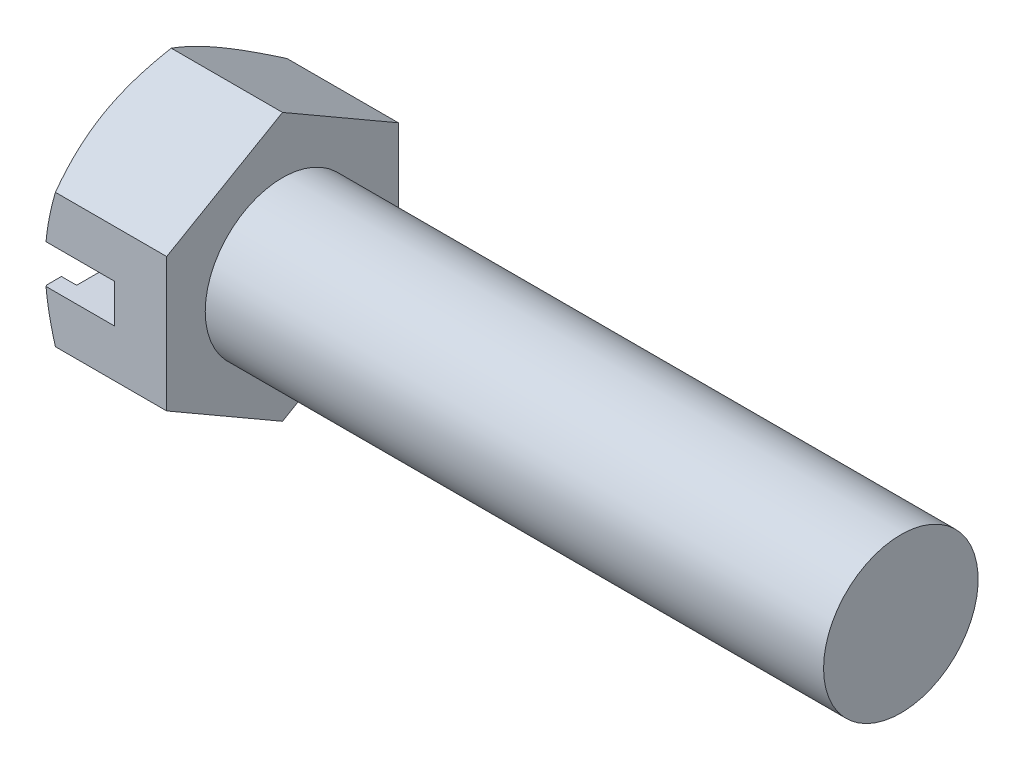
ISO-10303-21;
HEADER;
FILE_DESCRIPTION(('STEP AP214'),'2;1');
FILE_NAME('part.step','',(''),(''),'','','');
FILE_SCHEMA(('AUTOMOTIVE_DESIGN { 1 0 10303 214 1 1 1 1 }'));
ENDSEC;
DATA;
#1=APPLICATION_CONTEXT('core data for automotive mechanical design processes');
#2=APPLICATION_PROTOCOL_DEFINITION('international standard','automotive_design',2000,#1);
#3=PRODUCT_CONTEXT('',#1,'mechanical');
#4=PRODUCT('Part','Part','',(#3));
#5=PRODUCT_RELATED_PRODUCT_CATEGORY('part','',(#4));
#6=PRODUCT_DEFINITION_FORMATION('','',#4);
#7=PRODUCT_DEFINITION_CONTEXT('part definition',#1,'design');
#8=PRODUCT_DEFINITION('design','',#6,#7);
#9=PRODUCT_DEFINITION_SHAPE('','',#8);
#10=(LENGTH_UNIT() NAMED_UNIT(*) SI_UNIT(.MILLI.,.METRE.));
#11=(NAMED_UNIT(*) PLANE_ANGLE_UNIT() SI_UNIT($,.RADIAN.));
#12=(NAMED_UNIT(*) SI_UNIT($,.STERADIAN.) SOLID_ANGLE_UNIT());
#13=UNCERTAINTY_MEASURE_WITH_UNIT(LENGTH_MEASURE(1.E-05),#10,'distance_accuracy_value','');
#14=(GEOMETRIC_REPRESENTATION_CONTEXT(3) GLOBAL_UNCERTAINTY_ASSIGNED_CONTEXT((#13)) GLOBAL_UNIT_ASSIGNED_CONTEXT((#10,
#11,#12)) REPRESENTATION_CONTEXT('',''));
#15=CARTESIAN_POINT('',(0.,0.,0.));
#16=DIRECTION('',(0.,0.,1.));
#17=DIRECTION('',(1.,0.,0.));
#18=AXIS2_PLACEMENT_3D('',#15,#16,#17);
#19=CARTESIAN_POINT('',(4.2672,-1.1938,-8.241801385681));
#20=DIRECTION('',(0.,1.,0.));
#21=DIRECTION('',(0.,0.,1.));
#22=AXIS2_PLACEMENT_3D('',#19,#20,#21);
#23=PLANE('',#22);
#24=DIRECTION('',(0.,0.,-1.));
#25=VECTOR('',#24,1.);
#26=CARTESIAN_POINT('',(0.,-1.1938,0.));
#27=LINE('',#26,#25);
#28=CARTESIAN_POINT('',(0.,-1.1938,-6.13006336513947));
#29=VERTEX_POINT('',#28);
#30=CARTESIAN_POINT('',(0.,-1.1938,-7.03685443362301));
#31=VERTEX_POINT('',#30);
#32=EDGE_CURVE('E182',#29,#31,#27,.T.);
#33=ORIENTED_EDGE('',*,*,#32,.F.);
#34=DIRECTION('',(-1.,0.,0.));
#35=VECTOR('',#34,1.);
#36=CARTESIAN_POINT('',(0.936625,-1.1938,-6.13006336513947));
#37=LINE('',#36,#35);
#38=CARTESIAN_POINT('',(0.936625,-1.1938,-6.13006336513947));
#39=VERTEX_POINT('',#38);
#40=EDGE_CURVE('E426',#29,#39,#37,.F.);
#41=ORIENTED_EDGE('',*,*,#40,.T.);
#42=DIRECTION('',(0.,0.,-1.));
#43=VECTOR('',#42,1.);
#44=CARTESIAN_POINT('',(0.936625,-1.1938,-8.241801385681));
#45=LINE('',#44,#43);
#46=CARTESIAN_POINT('',(0.936625,-1.1938,6.13006336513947));
#47=VERTEX_POINT('',#46);
#48=EDGE_CURVE('E196',#47,#39,#45,.T.);
#49=ORIENTED_EDGE('',*,*,#48,.F.);
#50=DIRECTION('',(-1.,0.,0.));
#51=VECTOR('',#50,1.);
#52=CARTESIAN_POINT('',(0.936625,-1.1938,6.13006336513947));
#53=LINE('',#52,#51);
#54=CARTESIAN_POINT('',(0.,-1.1938,6.13006336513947));
#55=VERTEX_POINT('',#54);
#56=EDGE_CURVE('E446',#47,#55,#53,.T.);
#57=ORIENTED_EDGE('',*,*,#56,.T.);
#58=CARTESIAN_POINT('',(0.,-1.1938,7.03685443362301));
#59=VERTEX_POINT('',#58);
#60=EDGE_CURVE('E185',#59,#55,#27,.T.);
#61=ORIENTED_EDGE('',*,*,#60,.F.);
#62=CARTESIAN_POINT('',(3.26043260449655,-1.1938,12.7287757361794));
#63=CARTESIAN_POINT('',(2.98204474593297,-1.1938,12.2444551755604));
#64=CARTESIAN_POINT('',(2.70374242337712,-1.1938,11.7600853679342));
#65=CARTESIAN_POINT('',(2.14746424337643,-1.1938,10.79121068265));
#66=CARTESIAN_POINT('',(1.8694883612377,-1.1938,10.3067058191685));
#67=CARTESIAN_POINT('',(1.31403888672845,-1.1938,9.33756042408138));
#68=CARTESIAN_POINT('',(1.03656519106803,-1.1938,8.85291995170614));
#69=CARTESIAN_POINT('',(0.620878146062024,-1.1938,8.12563576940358));
#70=CARTESIAN_POINT('',(0.482397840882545,-1.1938,7.88314465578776));
#71=CARTESIAN_POINT('',(0.205671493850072,-1.1938,7.39802631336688));
#72=CARTESIAN_POINT('',(0.0674254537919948,-1.1938,7.1553990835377));
#73=CARTESIAN_POINT('',(-0.208818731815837,-1.1938,6.66984777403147));
#74=CARTESIAN_POINT('',(-0.346816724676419,-1.1938,6.42692360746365));
#75=CARTESIAN_POINT('',(-0.62237324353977,-1.1938,5.94083477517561));
#76=CARTESIAN_POINT('',(-0.759931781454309,-1.1938,5.69767011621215));
#77=CARTESIAN_POINT('',(-1.03438897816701,-1.1938,5.21104351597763));
#78=CARTESIAN_POINT('',(-1.17128778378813,-1.1938,4.96758165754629));
#79=CARTESIAN_POINT('',(-1.4441587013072,-1.1938,4.48010659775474));
#80=CARTESIAN_POINT('',(-1.58013072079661,-1.1938,4.23609334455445));
#81=CARTESIAN_POINT('',(-1.7829941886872,-1.1938,3.86933760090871));
#82=CARTESIAN_POINT('',(-1.85046016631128,-1.1938,3.74691304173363));
#83=CARTESIAN_POINT('',(-1.98488099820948,-1.1938,3.50178681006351));
#84=CARTESIAN_POINT('',(-2.05183586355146,-1.1938,3.37908514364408));
#85=CARTESIAN_POINT('',(-2.18504184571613,-1.1938,3.13334895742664));
#86=CARTESIAN_POINT('',(-2.25129317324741,-1.1938,3.01031455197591));
#87=CARTESIAN_POINT('',(-2.38285615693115,-1.1938,2.7637302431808));
#88=CARTESIAN_POINT('',(-2.44816773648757,-1.1938,2.64018029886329));
#89=CARTESIAN_POINT('',(-2.57750557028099,-1.1938,2.39222873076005));
#90=CARTESIAN_POINT('',(-2.64153027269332,-1.1938,2.26782629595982));
#91=CARTESIAN_POINT('',(-2.76753475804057,-1.1938,2.01801587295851));
#92=CARTESIAN_POINT('',(-2.82951499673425,-1.1938,1.89260811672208));
#93=CARTESIAN_POINT('',(-2.92008574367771,-1.1938,1.7032539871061));
#94=CARTESIAN_POINT('',(-2.94989305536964,-1.1938,1.63989083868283));
#95=CARTESIAN_POINT('',(-3.0084424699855,-1.1938,1.51268002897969));
#96=CARTESIAN_POINT('',(-3.03718466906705,-1.1938,1.44883241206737));
#97=CARTESIAN_POINT('',(-3.09331464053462,-1.1938,1.32048035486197));
#98=CARTESIAN_POINT('',(-3.12070135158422,-1.1938,1.25597544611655));
#99=CARTESIAN_POINT('',(-3.17361063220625,-1.1938,1.12618456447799));
#100=CARTESIAN_POINT('',(-3.19913261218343,-1.1938,1.06089835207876));
#101=CARTESIAN_POINT('',(-3.223470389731,-1.1938,0.995155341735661));
#102=B_SPLINE_CURVE_WITH_KNOTS('',3,(#62,#63,#64,#65,#66,#67,#68,#69,#70,#71,#72,#73,#74,#75,
#76,#77,#78,#79,#80,#81,#82,#83,#84,#85,#86,#87,#88,#89,#90,#91,#92,#93,#94,#95,#96,#97,#98,#99,
#100,#101),.UNSPECIFIED.,.F.,.F.,(4,2,2,2,2,2,2,2,2,2,2,2,2,2,2,2,2,2,2,4),(0.,1.67588667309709,
3.35163714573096,5.02699109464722,5.86473118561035,6.70247766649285,7.54063032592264,
8.37876007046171,9.21669377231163,10.054709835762,10.4740595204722,10.8934000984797,
11.3126113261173,11.7318565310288,12.1515801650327,12.5712095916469,12.7812741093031,
12.9913196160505,13.2015270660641,13.4118006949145),.UNSPECIFIED.);
#103=CARTESIAN_POINT('',(0.0572435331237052,-1.1938,7.1374));
#104=VERTEX_POINT('',#103);
#105=EDGE_CURVE('E311',#104,#59,#102,.T.);
#106=ORIENTED_EDGE('',*,*,#105,.F.);
#107=DIRECTION('',(-1.,0.,0.));
#108=VECTOR('',#107,1.);
#109=CARTESIAN_POINT('',(7.493,-1.1938,7.1374));
#110=LINE('',#109,#108);
#111=CARTESIAN_POINT('',(4.2672,-1.1938,7.1374));
#112=VERTEX_POINT('',#111);
#113=EDGE_CURVE('E318',#112,#104,#110,.T.);
#114=ORIENTED_EDGE('',*,*,#113,.F.);
#115=DIRECTION('',(0.,0.,-1.));
#116=VECTOR('',#115,1.);
#117=CARTESIAN_POINT('',(4.2672,-1.1938,-8.241801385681));
#118=LINE('',#117,#116);
#119=CARTESIAN_POINT('',(4.2672,-1.1938,-7.1374));
#120=VERTEX_POINT('',#119);
#121=EDGE_CURVE('E421',#112,#120,#118,.T.);
#122=ORIENTED_EDGE('',*,*,#121,.T.);
#123=DIRECTION('',(1.,0.,0.));
#124=VECTOR('',#123,1.);
#125=CARTESIAN_POINT('',(7.493,-1.1938,-7.1374));
#126=LINE('',#125,#124);
#127=CARTESIAN_POINT('',(0.0572435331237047,-1.1938,-7.1374));
#128=VERTEX_POINT('',#127);
#129=EDGE_CURVE('E319',#128,#120,#126,.T.);
#130=ORIENTED_EDGE('',*,*,#129,.F.);
#131=CARTESIAN_POINT('',(-3.223470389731,-1.1938,-0.995155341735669));
#132=CARTESIAN_POINT('',(-3.19924138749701,-1.1938,-1.06060564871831));
#133=CARTESIAN_POINT('',(-3.17383818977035,-1.1938,-1.1256031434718));
#134=CARTESIAN_POINT('',(-3.12118075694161,-1.1938,-1.25482287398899));
#135=CARTESIAN_POINT('',(-3.09392710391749,-1.1938,-1.31904534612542));
#136=CARTESIAN_POINT('',(-3.03807357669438,-1.1938,-1.44683300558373));
#137=CARTESIAN_POINT('',(-3.00947484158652,-1.1938,-1.51039869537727));
#138=CARTESIAN_POINT('',(-2.95121813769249,-1.1938,-1.63704855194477));
#139=CARTESIAN_POINT('',(-2.9215600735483,-1.1938,-1.7001326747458));
#140=CARTESIAN_POINT('',(-2.83143708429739,-1.1938,-1.88866522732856));
#141=CARTESIAN_POINT('',(-2.76976096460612,-1.1938,-2.01353350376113));
#142=CARTESIAN_POINT('',(-2.64436453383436,-1.1938,-2.26227255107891));
#143=CARTESIAN_POINT('',(-2.58064367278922,-1.1938,-2.38614304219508));
#144=CARTESIAN_POINT('',(-2.41929157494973,-1.1938,-2.69563915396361));
#145=CARTESIAN_POINT('',(-2.32080635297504,-1.1938,-2.88081872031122));
#146=CARTESIAN_POINT('',(-2.12205686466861,-1.1938,-3.25022110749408));
#147=CARTESIAN_POINT('',(-2.02179255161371,-1.1938,-3.43444390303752));
#148=CARTESIAN_POINT('',(-1.82013033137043,-1.1938,-3.80225262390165));
#149=CARTESIAN_POINT('',(-1.71873249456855,-1.1938,-3.98583858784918));
#150=CARTESIAN_POINT('',(-1.51516860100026,-1.1938,-4.35258440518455));
#151=CARTESIAN_POINT('',(-1.41300254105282,-1.1938,-4.53574425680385));
#152=CARTESIAN_POINT('',(-1.10543651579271,-1.1938,-5.0852656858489));
#153=CARTESIAN_POINT('',(-0.89923856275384,-1.1938,-5.45118036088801));
#154=CARTESIAN_POINT('',(-0.485698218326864,-1.1938,-6.18235721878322));
#155=CARTESIAN_POINT('',(-0.278355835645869,-1.1938,-6.54761940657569));
#156=CARTESIAN_POINT('',(0.205814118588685,-1.1938,-7.39864831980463));
#157=CARTESIAN_POINT('',(0.482912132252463,-1.1938,-7.88426115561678));
#158=CARTESIAN_POINT('',(1.03780984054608,-1.1938,-8.85508746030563));
#159=CARTESIAN_POINT('',(1.31560953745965,-1.1938,-9.34030092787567));
#160=CARTESIAN_POINT('',(1.87108240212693,-1.1938,-10.3094870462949));
#161=CARTESIAN_POINT('',(2.14875467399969,-1.1938,-10.7934602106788));
#162=CARTESIAN_POINT('',(2.70440087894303,-1.1938,-11.7612302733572));
#163=CARTESIAN_POINT('',(2.98237481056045,-1.1938,-12.2450271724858));
#164=CARTESIAN_POINT('',(3.26043260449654,-1.1938,-12.7287757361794));
#165=B_SPLINE_CURVE_WITH_KNOTS('',3,(#131,#132,#133,#134,#135,#136,#137,#138,#139,#140,#141,
#142,#143,#144,#145,#146,#147,#148,#149,#150,#151,#152,#153,#154,#155,#156,#157,#158,#159,#160,
#161,#162,#163,#164),.UNSPECIFIED.,.F.,.F.,(4,2,2,2,2,2,2,2,2,2,2,2,2,2,2,2,4),(0.,
0.209337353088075,0.418609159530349,0.627706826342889,0.836823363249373,1.2545977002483,
1.6724853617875,2.30168509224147,2.93090137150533,3.560078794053,4.1892588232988,
5.44929382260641,6.70931924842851,8.3866456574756,10.0639775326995,11.7378911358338,
13.4117967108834),.UNSPECIFIED.);
#166=EDGE_CURVE('E303',#31,#128,#165,.T.);
#167=ORIENTED_EDGE('',*,*,#166,.F.);
#168=EDGE_LOOP('',(#33,#41,#49,#57,#61,#106,#114,#122,#130,#167));
#169=FACE_BOUND('',#168,.T.);
#170=ADVANCED_FACE('F39',(#169),#23,.T.);
#171=CARTESIAN_POINT('',(4.2672,1.1938,8.241801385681));
#172=DIRECTION('',(0.,-1.,0.));
#173=DIRECTION('',(0.,0.,-1.));
#174=AXIS2_PLACEMENT_3D('',#171,#172,#173);
#175=PLANE('',#174);
#176=DIRECTION('',(0.,0.,1.));
#177=VECTOR('',#176,1.);
#178=CARTESIAN_POINT('',(0.,1.1938,0.));
#179=LINE('',#178,#177);
#180=CARTESIAN_POINT('',(0.,1.1938,6.13006336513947));
#181=VERTEX_POINT('',#180);
#182=CARTESIAN_POINT('',(0.,1.1938,7.03685443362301));
#183=VERTEX_POINT('',#182);
#184=EDGE_CURVE('E183',#181,#183,#179,.T.);
#185=ORIENTED_EDGE('',*,*,#184,.F.);
#186=DIRECTION('',(-1.,0.,0.));
#187=VECTOR('',#186,1.);
#188=CARTESIAN_POINT('',(0.936625,1.1938,6.13006336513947));
#189=LINE('',#188,#187);
#190=CARTESIAN_POINT('',(0.936625,1.1938,6.13006336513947));
#191=VERTEX_POINT('',#190);
#192=EDGE_CURVE('E11',#181,#191,#189,.F.);
#193=ORIENTED_EDGE('',*,*,#192,.T.);
#194=DIRECTION('',(0.,0.,1.));
#195=VECTOR('',#194,1.);
#196=CARTESIAN_POINT('',(0.936625,1.1938,8.241801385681));
#197=LINE('',#196,#195);
#198=CARTESIAN_POINT('',(0.936625,1.1938,-6.13006336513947));
#199=VERTEX_POINT('',#198);
#200=EDGE_CURVE('E176',#199,#191,#197,.T.);
#201=ORIENTED_EDGE('',*,*,#200,.F.);
#202=DIRECTION('',(-1.,0.,0.));
#203=VECTOR('',#202,1.);
#204=CARTESIAN_POINT('',(0.936625,1.1938,-6.13006336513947));
#205=LINE('',#204,#203);
#206=CARTESIAN_POINT('',(0.,1.1938,-6.13006336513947));
#207=VERTEX_POINT('',#206);
#208=EDGE_CURVE('E47',#199,#207,#205,.T.);
#209=ORIENTED_EDGE('',*,*,#208,.T.);
#210=CARTESIAN_POINT('',(0.,1.1938,-7.03685443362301));
#211=VERTEX_POINT('',#210);
#212=EDGE_CURVE('E174',#211,#207,#179,.T.);
#213=ORIENTED_EDGE('',*,*,#212,.F.);
#214=CARTESIAN_POINT('',(3.26043260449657,1.1938,-12.7287757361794));
#215=CARTESIAN_POINT('',(2.98204474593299,1.1938,-12.2444551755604));
#216=CARTESIAN_POINT('',(2.70374242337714,1.1938,-11.7600853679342));
#217=CARTESIAN_POINT('',(2.14746424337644,1.1938,-10.7912106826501));
#218=CARTESIAN_POINT('',(1.86948836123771,1.1938,-10.3067058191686));
#219=CARTESIAN_POINT('',(1.31403888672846,1.1938,-9.33756042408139));
#220=CARTESIAN_POINT('',(1.03656519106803,1.1938,-8.85291995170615));
#221=CARTESIAN_POINT('',(0.620878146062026,1.1938,-8.12563576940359));
#222=CARTESIAN_POINT('',(0.482397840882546,1.1938,-7.88314465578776));
#223=CARTESIAN_POINT('',(0.205671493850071,1.1938,-7.39802631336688));
#224=CARTESIAN_POINT('',(0.0674254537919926,1.1938,-7.1553990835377));
#225=CARTESIAN_POINT('',(-0.208818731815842,1.1938,-6.66984777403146));
#226=CARTESIAN_POINT('',(-0.346816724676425,1.1938,-6.42692360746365));
#227=CARTESIAN_POINT('',(-0.622373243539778,1.1938,-5.9408347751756));
#228=CARTESIAN_POINT('',(-0.759931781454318,1.1938,-5.69767011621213));
#229=CARTESIAN_POINT('',(-1.03438897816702,1.1938,-5.21104351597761));
#230=CARTESIAN_POINT('',(-1.17128778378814,1.1938,-4.96758165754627));
#231=CARTESIAN_POINT('',(-1.44415870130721,1.1938,-4.48010659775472));
#232=CARTESIAN_POINT('',(-1.58013072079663,1.1938,-4.23609334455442));
#233=CARTESIAN_POINT('',(-1.78299418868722,1.1938,-3.86933760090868));
#234=CARTESIAN_POINT('',(-1.8504601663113,1.1938,-3.74691304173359));
#235=CARTESIAN_POINT('',(-1.98488099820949,1.1938,-3.50178681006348));
#236=CARTESIAN_POINT('',(-2.05183586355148,1.1938,-3.37908514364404));
#237=CARTESIAN_POINT('',(-2.18504184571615,1.1938,-3.1333489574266));
#238=CARTESIAN_POINT('',(-2.25129317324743,1.1938,-3.01031455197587));
#239=CARTESIAN_POINT('',(-2.38285615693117,1.1938,-2.76373024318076));
#240=CARTESIAN_POINT('',(-2.44816773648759,1.1938,-2.64018029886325));
#241=CARTESIAN_POINT('',(-2.57750557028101,1.1938,-2.39222873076));
#242=CARTESIAN_POINT('',(-2.64153027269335,1.1938,-2.26782629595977));
#243=CARTESIAN_POINT('',(-2.76753475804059,1.1938,-2.01801587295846));
#244=CARTESIAN_POINT('',(-2.82951499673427,1.1938,-1.89260811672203));
#245=CARTESIAN_POINT('',(-2.92008574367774,1.1938,-1.70325398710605));
#246=CARTESIAN_POINT('',(-2.94989305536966,1.1938,-1.63989083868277));
#247=CARTESIAN_POINT('',(-3.00844246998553,1.1938,-1.51268002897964));
#248=CARTESIAN_POINT('',(-3.03718466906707,1.1938,-1.44883241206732));
#249=CARTESIAN_POINT('',(-3.09331464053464,1.1938,-1.32048035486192));
#250=CARTESIAN_POINT('',(-3.12070135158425,1.1938,-1.25597544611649));
#251=CARTESIAN_POINT('',(-3.17361063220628,1.1938,-1.12618456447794));
#252=CARTESIAN_POINT('',(-3.19913261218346,1.1938,-1.0608983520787));
#253=CARTESIAN_POINT('',(-3.22347038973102,1.1938,-0.995155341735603));
#254=B_SPLINE_CURVE_WITH_KNOTS('',3,(#214,#215,#216,#217,#218,#219,#220,#221,#222,#223,#224,
#225,#226,#227,#228,#229,#230,#231,#232,#233,#234,#235,#236,#237,#238,#239,#240,#241,#242,#243,
#244,#245,#246,#247,#248,#249,#250,#251,#252,#253),.UNSPECIFIED.,.F.,.F.,(4,2,2,2,2,2,2,2,2,2,2,
2,2,2,2,2,2,2,2,4),(0.,1.6758866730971,3.35163714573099,5.02699109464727,5.8647311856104,
6.70247766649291,7.5406303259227,8.37876007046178,9.21669377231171,10.054709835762,
10.4740595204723,10.8934000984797,11.3126113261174,11.7318565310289,12.1515801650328,
12.571209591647,12.7812741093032,12.9913196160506,13.2015270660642,13.4118006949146),.UNSPECIFIED.);
#255=CARTESIAN_POINT('',(0.0572435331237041,1.1938,-7.1374));
#256=VERTEX_POINT('',#255);
#257=EDGE_CURVE('E435',#256,#211,#254,.T.);
#258=ORIENTED_EDGE('',*,*,#257,.F.);
#259=DIRECTION('',(-1.,0.,0.));
#260=VECTOR('',#259,1.);
#261=CARTESIAN_POINT('',(7.493,1.1938,-7.1374));
#262=LINE('',#261,#260);
#263=CARTESIAN_POINT('',(4.2672,1.1938,-7.1374));
#264=VERTEX_POINT('',#263);
#265=EDGE_CURVE('E423',#264,#256,#262,.T.);
#266=ORIENTED_EDGE('',*,*,#265,.F.);
#267=DIRECTION('',(0.,0.,1.));
#268=VECTOR('',#267,1.);
#269=CARTESIAN_POINT('',(4.2672,1.1938,8.241801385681));
#270=LINE('',#269,#268);
#271=CARTESIAN_POINT('',(4.2672,1.1938,7.1374));
#272=VERTEX_POINT('',#271);
#273=EDGE_CURVE('E420',#264,#272,#270,.T.);
#274=ORIENTED_EDGE('',*,*,#273,.T.);
#275=DIRECTION('',(1.,0.,0.));
#276=VECTOR('',#275,1.);
#277=CARTESIAN_POINT('',(7.493,1.1938,7.1374));
#278=LINE('',#277,#276);
#279=CARTESIAN_POINT('',(0.0572435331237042,1.1938,7.1374));
#280=VERTEX_POINT('',#279);
#281=EDGE_CURVE('E415',#280,#272,#278,.T.);
#282=ORIENTED_EDGE('',*,*,#281,.F.);
#283=CARTESIAN_POINT('',(-3.22347038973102,1.1938,0.995155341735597));
#284=CARTESIAN_POINT('',(-3.19924138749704,1.1938,1.06060564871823));
#285=CARTESIAN_POINT('',(-3.17383818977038,1.1938,1.12560314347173));
#286=CARTESIAN_POINT('',(-3.12118075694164,1.1938,1.25482287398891));
#287=CARTESIAN_POINT('',(-3.09392710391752,1.1938,1.31904534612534));
#288=CARTESIAN_POINT('',(-3.03807357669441,1.1938,1.44683300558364));
#289=CARTESIAN_POINT('',(-3.00947484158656,1.1938,1.51039869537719));
#290=CARTESIAN_POINT('',(-2.95121813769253,1.1938,1.63704855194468));
#291=CARTESIAN_POINT('',(-2.92156007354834,1.1938,1.70013267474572));
#292=CARTESIAN_POINT('',(-2.83143708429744,1.1938,1.88866522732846));
#293=CARTESIAN_POINT('',(-2.76976096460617,1.1938,2.01353350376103));
#294=CARTESIAN_POINT('',(-2.64436453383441,1.1938,2.26227255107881));
#295=CARTESIAN_POINT('',(-2.58064367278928,1.1938,2.38614304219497));
#296=CARTESIAN_POINT('',(-2.41929157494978,1.1938,2.69563915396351));
#297=CARTESIAN_POINT('',(-2.32080635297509,1.1938,2.88081872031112));
#298=CARTESIAN_POINT('',(-2.12205686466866,1.1938,3.25022110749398));
#299=CARTESIAN_POINT('',(-2.02179255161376,1.1938,3.43444390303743));
#300=CARTESIAN_POINT('',(-1.82013033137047,1.1938,3.80225262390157));
#301=CARTESIAN_POINT('',(-1.7187324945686,1.1938,3.9858385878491));
#302=CARTESIAN_POINT('',(-1.51516860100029,1.1938,4.35258440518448));
#303=CARTESIAN_POINT('',(-1.41300254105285,1.1938,4.53574425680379));
#304=CARTESIAN_POINT('',(-1.10543651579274,1.1938,5.08526568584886));
#305=CARTESIAN_POINT('',(-0.899238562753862,1.1938,5.45118036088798));
#306=CARTESIAN_POINT('',(-0.485698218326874,1.1938,6.1823572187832));
#307=CARTESIAN_POINT('',(-0.278355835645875,1.1938,6.54761940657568));
#308=CARTESIAN_POINT('',(0.205814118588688,1.1938,7.39864831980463));
#309=CARTESIAN_POINT('',(0.48291213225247,1.1938,7.8842611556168));
#310=CARTESIAN_POINT('',(1.03780984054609,1.1938,8.85508746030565));
#311=CARTESIAN_POINT('',(1.31560953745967,1.1938,9.3403009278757));
#312=CARTESIAN_POINT('',(1.87108240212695,1.1938,10.3094870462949));
#313=CARTESIAN_POINT('',(2.14875467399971,1.1938,10.7934602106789));
#314=CARTESIAN_POINT('',(2.70440087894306,1.1938,11.7612302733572));
#315=CARTESIAN_POINT('',(2.98237481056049,1.1938,12.2450271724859));
#316=CARTESIAN_POINT('',(3.26043260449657,1.1938,12.7287757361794));
#317=B_SPLINE_CURVE_WITH_KNOTS('',3,(#283,#284,#285,#286,#287,#288,#289,#290,#291,#292,#293,
#294,#295,#296,#297,#298,#299,#300,#301,#302,#303,#304,#305,#306,#307,#308,#309,#310,#311,#312,
#313,#314,#315,#316),.UNSPECIFIED.,.F.,.F.,(4,2,2,2,2,2,2,2,2,2,2,2,2,2,2,2,4),(0.,
0.209337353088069,0.418609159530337,0.627706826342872,0.83682336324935,1.25459770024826,
1.67248536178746,2.30168509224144,2.93090137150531,3.560078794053,4.18925882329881,
5.44929382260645,6.70931924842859,8.3866456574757,10.0639775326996,11.737891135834,
13.4117967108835),.UNSPECIFIED.);
#318=EDGE_CURVE('E200',#183,#280,#317,.T.);
#319=ORIENTED_EDGE('',*,*,#318,.F.);
#320=EDGE_LOOP('',(#185,#193,#201,#209,#213,#258,#266,#274,#282,#319));
#321=FACE_BOUND('',#320,.T.);
#322=ADVANCED_FACE('F173',(#321),#175,.T.);
#323=CARTESIAN_POINT('',(7.493,-4.12077982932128,7.13740000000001));
#324=DIRECTION('',(0.,0.,1.));
#325=DIRECTION('',(0.,-1.,0.));
#326=AXIS2_PLACEMENT_3D('',#323,#324,#325);
#327=PLANE('',#326);
#328=DIRECTION('',(0.,-1.,0.));
#329=VECTOR('',#328,1.);
#330=CARTESIAN_POINT('',(4.2672,-4.12077982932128,7.13740000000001));
#331=LINE('',#330,#329);
#332=EDGE_CURVE('E322',#272,#112,#331,.T.);
#333=ORIENTED_EDGE('',*,*,#332,.T.);
#334=ORIENTED_EDGE('',*,*,#113,.T.);
#335=CARTESIAN_POINT('',(3.4154458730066,-10.9289347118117,7.13740000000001));
#336=CARTESIAN_POINT('',(3.26400695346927,-10.6155623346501,7.13740000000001));
#337=CARTESIAN_POINT('',(3.114073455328,-10.3014490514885,7.13740000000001));
#338=CARTESIAN_POINT('',(2.81807755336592,-9.67134004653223,7.13740000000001));
#339=CARTESIAN_POINT('',(2.67201581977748,-9.35534401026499,7.13740000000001));
#340=CARTESIAN_POINT('',(2.38385424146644,-8.71936189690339,7.13740000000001));
#341=CARTESIAN_POINT('',(2.24178185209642,-8.39936333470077,7.13740000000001));
#342=CARTESIAN_POINT('',(1.96373939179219,-7.75673617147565,7.13740000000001));
#343=CARTESIAN_POINT('',(1.82776900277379,-7.43410770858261,7.13740000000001));
#344=CARTESIAN_POINT('',(1.56193891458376,-6.78170205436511,7.13740000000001));
#345=CARTESIAN_POINT('',(1.4321747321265,-6.4518857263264,7.13740000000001));
#346=CARTESIAN_POINT('',(1.18280932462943,-5.78836373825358,7.13740000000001));
#347=CARTESIAN_POINT('',(1.06320923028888,-5.45465765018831,7.13740000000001));
#348=CARTESIAN_POINT('',(0.837386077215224,-4.78350650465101,7.13740000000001));
#349=CARTESIAN_POINT('',(0.731134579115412,-4.44607112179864,7.13740000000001));
#350=CARTESIAN_POINT('',(0.535457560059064,-3.76641539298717,7.13740000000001));
#351=CARTESIAN_POINT('',(0.446026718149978,-3.42419659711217,7.1374));
#352=CARTESIAN_POINT('',(0.288339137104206,-2.73468312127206,7.1374));
#353=CARTESIAN_POINT('',(0.220088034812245,-2.38738711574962,7.1374));
#354=CARTESIAN_POINT('',(0.137013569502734,-1.86338701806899,7.1374));
#355=CARTESIAN_POINT('',(0.112537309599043,-1.68818947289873,7.1374));
#356=CARTESIAN_POINT('',(0.0705004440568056,-1.33697297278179,7.1374));
#357=CARTESIAN_POINT('',(0.0529391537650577,-1.16095410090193,7.1374));
#358=CARTESIAN_POINT('',(0.0252048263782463,-0.809449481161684,7.1374));
#359=CARTESIAN_POINT('',(0.0149859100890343,-0.633967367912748,7.1374));
#360=CARTESIAN_POINT('',(0.00199035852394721,-0.282727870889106,7.1374));
#361=CARTESIAN_POINT('',(-0.000786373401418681,-0.106970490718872,7.1374));
#362=CARTESIAN_POINT('',(0.00116860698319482,0.244453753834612,7.1374));
#363=CARTESIAN_POINT('',(0.00589821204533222,0.420120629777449,7.1374));
#364=CARTESIAN_POINT('',(0.0227482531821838,0.77110192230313,7.1374));
#365=CARTESIAN_POINT('',(0.0348690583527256,0.946416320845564,7.1374));
#366=CARTESIAN_POINT('',(0.0729504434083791,1.37132382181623,7.1374));
#367=CARTESIAN_POINT('',(0.102614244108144,1.62059046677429,7.1374));
#368=CARTESIAN_POINT('',(0.17523719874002,2.11721366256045,7.1374));
#369=CARTESIAN_POINT('',(0.218199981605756,2.36456967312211,7.1374));
#370=CARTESIAN_POINT('',(0.3158971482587,2.8571675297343,7.1374));
#371=CARTESIAN_POINT('',(0.370642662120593,3.10240714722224,7.1374));
#372=CARTESIAN_POINT('',(0.490234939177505,3.59036322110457,7.1374));
#373=CARTESIAN_POINT('',(0.555080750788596,3.8330799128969,7.1374));
#374=CARTESIAN_POINT('',(0.695017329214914,4.32196822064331,7.1374));
#375=CARTESIAN_POINT('',(0.770320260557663,4.56807868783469,7.1374));
#376=CARTESIAN_POINT('',(0.928366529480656,5.0576982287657,7.1374));
#377=CARTESIAN_POINT('',(1.01110473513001,5.30120896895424,7.1374));
#378=CARTESIAN_POINT('',(1.18231251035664,5.78465193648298,7.1374));
#379=CARTESIAN_POINT('',(1.27074719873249,6.02459659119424,7.1374));
#380=CARTESIAN_POINT('',(1.45280721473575,6.50262425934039,7.1374));
#381=CARTESIAN_POINT('',(1.54643464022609,6.74070647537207,7.1374));
#382=CARTESIAN_POINT('',(1.64214475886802,6.97792376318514,7.1374));
#383=B_SPLINE_CURVE_WITH_KNOTS('',3,(#335,#336,#337,#338,#339,#340,#341,#342,#343,#344,#345,
#346,#347,#348,#349,#350,#351,#352,#353,#354,#355,#356,#357,#358,#359,#360,#361,#362,#363,#364,
#365,#366,#367,#368,#369,#370,#371,#372,#373,#374,#375,#376,#377,#378,#379,#380,#381,#382),
.UNSPECIFIED.,.F.,.F.,(4,2,2,2,2,2,2,2,2,2,2,2,2,2,2,2,2,2,2,2,2,2,2,4),(0.,1.0441518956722,
2.08848337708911,3.13879111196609,4.18904403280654,5.25219109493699,6.31545627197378,
7.37641628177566,8.43704010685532,9.49794596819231,10.0285279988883,10.559057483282,
11.0862423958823,11.6134204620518,12.1404505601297,12.6675069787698,13.4201640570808,
14.1730266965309,14.9266036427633,15.6801096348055,16.4520857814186,17.2235331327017,
17.9906382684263,18.7580556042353),.UNSPECIFIED.);
#384=CARTESIAN_POINT('',(0.637486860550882,-4.12077982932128,7.13740000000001));
#385=VERTEX_POINT('',#384);
#386=EDGE_CURVE('E242',#385,#104,#383,.T.);
#387=ORIENTED_EDGE('',*,*,#386,.F.);
#388=DIRECTION('',(-1.,0.,0.));
#389=VECTOR('',#388,1.);
#390=CARTESIAN_POINT('',(7.493,-4.12077982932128,7.13740000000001));
#391=LINE('',#390,#389);
#392=CARTESIAN_POINT('',(7.493,-4.12077982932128,7.13740000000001));
#393=VERTEX_POINT('',#392);
#394=EDGE_CURVE('E223',#393,#385,#391,.T.);
#395=ORIENTED_EDGE('',*,*,#394,.F.);
#396=DIRECTION('',(0.,1.,0.));
#397=VECTOR('',#396,1.);
#398=CARTESIAN_POINT('',(7.493,-4.12077982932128,7.13740000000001));
#399=LINE('',#398,#397);
#400=CARTESIAN_POINT('',(7.493,4.12077982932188,7.1374));
#401=VERTEX_POINT('',#400);
#402=EDGE_CURVE('E325',#393,#401,#399,.T.);
#403=ORIENTED_EDGE('',*,*,#402,.T.);
#404=DIRECTION('',(-1.,0.,0.));
#405=VECTOR('',#404,1.);
#406=CARTESIAN_POINT('',(7.493,4.12077982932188,7.1374));
#407=LINE('',#406,#405);
#408=CARTESIAN_POINT('',(0.637486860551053,4.12077982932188,7.1374));
#409=VERTEX_POINT('',#408);
#410=EDGE_CURVE('E341',#401,#409,#407,.T.);
#411=ORIENTED_EDGE('',*,*,#410,.T.);
#412=EDGE_CURVE('E227',#280,#409,#383,.T.);
#413=ORIENTED_EDGE('',*,*,#412,.F.);
#414=ORIENTED_EDGE('',*,*,#281,.T.);
#415=EDGE_LOOP('',(#333,#334,#387,#395,#403,#411,#413,#414));
#416=FACE_BOUND('',#415,.T.);
#417=ADVANCED_FACE('F265',(#416),#327,.T.);
#418=CARTESIAN_POINT('',(7.493,4.12077982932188,-7.1374));
#419=DIRECTION('',(0.,0.,-1.));
#420=DIRECTION('',(-1.,0.,0.));
#421=AXIS2_PLACEMENT_3D('',#418,#419,#420);
#422=PLANE('',#421);
#423=CARTESIAN_POINT('',(3.4154458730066,-10.9289347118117,-7.1374));
#424=CARTESIAN_POINT('',(3.26400695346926,-10.6155623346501,-7.1374));
#425=CARTESIAN_POINT('',(3.114073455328,-10.3014490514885,-7.1374));
#426=CARTESIAN_POINT('',(2.81807755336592,-9.67134004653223,-7.1374));
#427=CARTESIAN_POINT('',(2.67201581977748,-9.35534401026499,-7.1374));
#428=CARTESIAN_POINT('',(2.38385424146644,-8.71936189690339,-7.1374));
#429=CARTESIAN_POINT('',(2.24178185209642,-8.39936333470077,-7.1374));
#430=CARTESIAN_POINT('',(1.96373939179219,-7.75673617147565,-7.1374));
#431=CARTESIAN_POINT('',(1.82776900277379,-7.43410770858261,-7.1374));
#432=CARTESIAN_POINT('',(1.56193891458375,-6.78170205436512,-7.1374));
#433=CARTESIAN_POINT('',(1.4321747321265,-6.4518857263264,-7.1374));
#434=CARTESIAN_POINT('',(1.18280932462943,-5.78836373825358,-7.1374));
#435=CARTESIAN_POINT('',(1.06320923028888,-5.45465765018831,-7.1374));
#436=CARTESIAN_POINT('',(0.837386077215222,-4.78350650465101,-7.1374));
#437=CARTESIAN_POINT('',(0.731134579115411,-4.44607112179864,-7.1374));
#438=CARTESIAN_POINT('',(0.535457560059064,-3.76641539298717,-7.1374));
#439=CARTESIAN_POINT('',(0.446026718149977,-3.42419659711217,-7.1374));
#440=CARTESIAN_POINT('',(0.288339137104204,-2.73468312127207,-7.1374));
#441=CARTESIAN_POINT('',(0.220088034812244,-2.38738711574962,-7.1374));
#442=CARTESIAN_POINT('',(0.137013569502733,-1.86338701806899,-7.1374));
#443=CARTESIAN_POINT('',(0.112537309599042,-1.68818947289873,-7.1374));
#444=CARTESIAN_POINT('',(0.0705004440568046,-1.33697297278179,-7.1374));
#445=CARTESIAN_POINT('',(0.0529391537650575,-1.16095410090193,-7.1374));
#446=CARTESIAN_POINT('',(0.0252048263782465,-0.809449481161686,-7.1374));
#447=CARTESIAN_POINT('',(0.0149859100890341,-0.63396736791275,-7.1374));
#448=CARTESIAN_POINT('',(0.00199035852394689,-0.282727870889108,-7.1374));
#449=CARTESIAN_POINT('',(-0.000786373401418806,-0.106970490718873,-7.1374));
#450=CARTESIAN_POINT('',(0.00116860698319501,0.244453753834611,-7.1374));
#451=CARTESIAN_POINT('',(0.00589821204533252,0.420120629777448,-7.1374));
#452=CARTESIAN_POINT('',(0.0227482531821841,0.771101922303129,-7.1374));
#453=CARTESIAN_POINT('',(0.0348690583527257,0.946416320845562,-7.1374));
#454=CARTESIAN_POINT('',(0.0729504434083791,1.37132382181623,-7.1374));
#455=CARTESIAN_POINT('',(0.102614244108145,1.62059046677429,-7.1374));
#456=CARTESIAN_POINT('',(0.17523719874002,2.11721366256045,-7.1374));
#457=CARTESIAN_POINT('',(0.218199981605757,2.36456967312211,-7.1374));
#458=CARTESIAN_POINT('',(0.3158971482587,2.8571675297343,-7.1374));
#459=CARTESIAN_POINT('',(0.370642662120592,3.10240714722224,-7.1374));
#460=CARTESIAN_POINT('',(0.490234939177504,3.59036322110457,-7.1374));
#461=CARTESIAN_POINT('',(0.555080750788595,3.83307991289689,-7.1374));
#462=CARTESIAN_POINT('',(0.695017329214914,4.32196822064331,-7.1374));
#463=CARTESIAN_POINT('',(0.770320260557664,4.56807868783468,-7.1374));
#464=CARTESIAN_POINT('',(0.928366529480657,5.0576982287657,-7.1374));
#465=CARTESIAN_POINT('',(1.01110473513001,5.30120896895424,-7.1374));
#466=CARTESIAN_POINT('',(1.18231251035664,5.78465193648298,-7.1374));
#467=CARTESIAN_POINT('',(1.2707471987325,6.02459659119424,-7.1374));
#468=CARTESIAN_POINT('',(1.45280721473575,6.50262425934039,-7.1374));
#469=CARTESIAN_POINT('',(1.54643464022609,6.74070647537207,-7.1374));
#470=CARTESIAN_POINT('',(1.64214475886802,6.97792376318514,-7.1374));
#471=B_SPLINE_CURVE_WITH_KNOTS('',3,(#423,#424,#425,#426,#427,#428,#429,#430,#431,#432,#433,
#434,#435,#436,#437,#438,#439,#440,#441,#442,#443,#444,#445,#446,#447,#448,#449,#450,#451,#452,
#453,#454,#455,#456,#457,#458,#459,#460,#461,#462,#463,#464,#465,#466,#467,#468,#469,#470),
.UNSPECIFIED.,.F.,.F.,(4,2,2,2,2,2,2,2,2,2,2,2,2,2,2,2,2,2,2,2,2,2,2,4),(0.,1.0441518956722,
2.0884833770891,3.13879111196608,4.18904403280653,5.25219109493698,6.31545627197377,
7.37641628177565,8.43704010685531,9.4979459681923,10.0285279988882,10.559057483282,
11.0862423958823,11.6134204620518,12.1404505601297,12.6675069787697,13.4201640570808,
14.1730266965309,14.9266036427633,15.6801096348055,16.4520857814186,17.2235331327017,
17.9906382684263,18.7580556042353),.UNSPECIFIED.);
#472=CARTESIAN_POINT('',(0.63748686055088,-4.12077982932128,-7.1374));
#473=VERTEX_POINT('',#472);
#474=EDGE_CURVE('E365',#128,#473,#471,.F.);
#475=ORIENTED_EDGE('',*,*,#474,.F.);
#476=ORIENTED_EDGE('',*,*,#129,.T.);
#477=DIRECTION('',(0.,1.,0.));
#478=VECTOR('',#477,1.);
#479=CARTESIAN_POINT('',(4.2672,4.12077982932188,-7.1374));
#480=LINE('',#479,#478);
#481=EDGE_CURVE('E192',#120,#264,#480,.T.);
#482=ORIENTED_EDGE('',*,*,#481,.T.);
#483=ORIENTED_EDGE('',*,*,#265,.T.);
#484=CARTESIAN_POINT('',(0.637486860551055,4.12077982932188,-7.1374));
#485=VERTEX_POINT('',#484);
#486=EDGE_CURVE('E389',#485,#256,#471,.F.);
#487=ORIENTED_EDGE('',*,*,#486,.F.);
#488=DIRECTION('',(-1.,0.,0.));
#489=VECTOR('',#488,1.);
#490=CARTESIAN_POINT('',(7.493,4.12077982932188,-7.1374));
#491=LINE('',#490,#489);
#492=CARTESIAN_POINT('',(7.493,4.12077982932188,-7.1374));
#493=VERTEX_POINT('',#492);
#494=EDGE_CURVE('E350',#493,#485,#491,.T.);
#495=ORIENTED_EDGE('',*,*,#494,.F.);
#496=DIRECTION('',(0.,-1.,0.));
#497=VECTOR('',#496,1.);
#498=CARTESIAN_POINT('',(7.493,4.12077982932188,-7.1374));
#499=LINE('',#498,#497);
#500=CARTESIAN_POINT('',(7.493,-4.12077982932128,-7.1374));
#501=VERTEX_POINT('',#500);
#502=EDGE_CURVE('E332',#493,#501,#499,.T.);
#503=ORIENTED_EDGE('',*,*,#502,.T.);
#504=DIRECTION('',(-1.,0.,0.));
#505=VECTOR('',#504,1.);
#506=CARTESIAN_POINT('',(7.493,-4.12077982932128,-7.1374));
#507=LINE('',#506,#505);
#508=EDGE_CURVE('E347',#501,#473,#507,.T.);
#509=ORIENTED_EDGE('',*,*,#508,.T.);
#510=EDGE_LOOP('',(#475,#476,#482,#483,#487,#495,#503,#509));
#511=FACE_BOUND('',#510,.T.);
#512=ADVANCED_FACE('F270',(#511),#422,.T.);
#513=CARTESIAN_POINT('',(0.,0.,0.));
#514=DIRECTION('',(1.,0.,0.));
#515=DIRECTION('',(0.,0.,-1.));
#516=AXIS2_PLACEMENT_3D('',#513,#514,#515);
#517=CONICAL_SURFACE('',#516,7.13739999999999,1.0471975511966);
#518=ORIENTED_EDGE('',*,*,#386,.T.);
#519=ORIENTED_EDGE('',*,*,#105,.T.);
#520=CARTESIAN_POINT('',(0.,0.,0.));
#521=DIRECTION('',(-1.,0.,0.));
#522=DIRECTION('',(0.,0.,1.));
#523=AXIS2_PLACEMENT_3D('',#520,#521,#522);
#524=CIRCLE('',#523,7.13739999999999);
#525=CARTESIAN_POINT('',(0.,-6.18116973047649,3.5687000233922));
#526=VERTEX_POINT('',#525);
#527=EDGE_CURVE('E208',#526,#59,#524,.T.);
#528=ORIENTED_EDGE('',*,*,#527,.F.);
#529=CARTESIAN_POINT('',(0.63755354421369,-8.24167512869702,-0.000200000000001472));
#530=CARTESIAN_POINT('',(0.585265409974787,-8.15109575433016,0.156688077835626));
#531=CARTESIAN_POINT('',(0.53535030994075,-8.06017865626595,0.314161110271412));
#532=CARTESIAN_POINT('',(0.440919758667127,-7.87760611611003,0.630386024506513));
#533=CARTESIAN_POINT('',(0.396406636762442,-7.78595037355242,0.789138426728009));
#534=CARTESIAN_POINT('',(0.271843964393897,-7.50951562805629,1.26793744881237));
#535=CARTESIAN_POINT('',(0.200994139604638,-7.32364544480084,1.58987404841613));
#536=CARTESIAN_POINT('',(0.117914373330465,-7.04549409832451,2.07164631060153));
#537=CARTESIAN_POINT('',(0.0942473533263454,-6.95404401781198,2.23004249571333));
#538=CARTESIAN_POINT('',(0.0545612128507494,-6.77073064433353,2.54755057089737));
#539=CARTESIAN_POINT('',(0.0385414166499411,-6.67886738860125,2.70666239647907));
#540=CARTESIAN_POINT('',(0.0145579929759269,-6.49498133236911,3.0251623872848));
#541=CARTESIAN_POINT('',(0.0065852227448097,-6.40295883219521,3.18455003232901));
#542=CARTESIAN_POINT('',(-0.00114174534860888,-6.2188339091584,3.50346375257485));
#543=CARTESIAN_POINT('',(-0.00089619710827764,-6.12673148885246,3.6629898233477));
#544=CARTESIAN_POINT('',(0.0110730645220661,-5.87440163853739,4.10003794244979));
#545=CARTESIAN_POINT('',(0.0311658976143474,-5.71425680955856,4.37741692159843));
#546=CARTESIAN_POINT('',(0.0948800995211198,-5.39503081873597,4.93033255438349));
#547=CARTESIAN_POINT('',(0.138523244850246,-5.23595077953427,5.20586726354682));
#548=CARTESIAN_POINT('',(0.247618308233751,-4.91608236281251,5.75989561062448));
#549=CARTESIAN_POINT('',(0.313532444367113,-4.75533434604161,6.03831934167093));
#550=CARTESIAN_POINT('',(0.463130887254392,-4.43623550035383,6.59101475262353));
#551=CARTESIAN_POINT('',(0.546780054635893,-4.2778805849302,6.86529351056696));
#552=CARTESIAN_POINT('',(0.637553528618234,-4.12066435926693,7.1376));
#553=B_SPLINE_CURVE_WITH_KNOTS('',3,(#529,#530,#531,#532,#533,#534,#535,#536,#537,#538,#539,
#540,#541,#542,#543,#544,#545,#546,#547,#548,#549,#550,#551,#552),.UNSPECIFIED.,.F.,.F.,(4,2,2,
2,2,2,2,2,2,2,2,4),(0.,0.565616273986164,1.1314755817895,2.26554548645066,2.81869147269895,
3.37178857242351,3.92425655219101,4.47670746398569,5.43845616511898,6.40109570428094,
7.38508512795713,8.36714284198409),.UNSPECIFIED.);
#554=EDGE_CURVE('E255',#526,#385,#553,.T.);
#555=ORIENTED_EDGE('',*,*,#554,.T.);
#556=EDGE_LOOP('',(#518,#519,#528,#555));
#557=FACE_BOUND('',#556,.T.);
#558=ADVANCED_FACE('F262',(#557),#517,.T.);
#559=CARTESIAN_POINT('',(0.,-6.18116973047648,-3.5687000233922));
#560=VERTEX_POINT('',#559);
#561=EDGE_CURVE('E209',#31,#560,#524,.T.);
#562=ORIENTED_EDGE('',*,*,#561,.F.);
#563=ORIENTED_EDGE('',*,*,#166,.T.);
#564=ORIENTED_EDGE('',*,*,#474,.T.);
#565=CARTESIAN_POINT('',(0.637553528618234,-4.12066435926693,-7.1376));
#566=CARTESIAN_POINT('',(0.585265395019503,-4.21124373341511,-6.98071192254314));
#567=CARTESIAN_POINT('',(0.535350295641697,-4.30216083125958,-6.82323889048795));
#568=CARTESIAN_POINT('',(0.440919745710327,-4.48473337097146,-6.50701397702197));
#569=CARTESIAN_POINT('',(0.396406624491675,-4.57638911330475,-6.348261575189));
#570=CARTESIAN_POINT('',(0.271843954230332,-4.85282385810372,-5.86946255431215));
#571=CARTESIAN_POINT('',(0.200994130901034,-5.03869404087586,-5.54752595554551));
#572=CARTESIAN_POINT('',(0.117914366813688,-5.31684538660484,-5.06575369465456));
#573=CARTESIAN_POINT('',(0.0942473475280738,-5.40829546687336,-4.90735750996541));
#574=CARTESIAN_POINT('',(0.0545612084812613,-5.59160883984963,-4.58984943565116));
#575=CARTESIAN_POINT('',(0.0385414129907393,-5.68347209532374,-4.43073761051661));
#576=CARTESIAN_POINT('',(0.0145579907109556,-5.86735815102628,-4.11223762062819));
#577=CARTESIAN_POINT('',(0.00658522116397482,-5.95938065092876,-3.9528499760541));
#578=CARTESIAN_POINT('',(-0.0011417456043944,-6.14350557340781,-3.63393625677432));
#579=CARTESIAN_POINT('',(-0.000896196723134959,-6.23560799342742,-3.47441018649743));
#580=CARTESIAN_POINT('',(0.0110730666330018,-6.48793784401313,-3.03736206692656));
#581=CARTESIAN_POINT('',(0.0311659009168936,-6.64808267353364,-2.7599830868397));
#582=CARTESIAN_POINT('',(0.0948801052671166,-6.96730866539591,-2.20706745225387));
#583=CARTESIAN_POINT('',(0.138523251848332,-7.12638870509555,-1.93153274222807));
#584=CARTESIAN_POINT('',(0.247618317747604,-7.44625712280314,-1.37750439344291));
#585=CARTESIAN_POINT('',(0.313532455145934,-7.60700514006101,-1.099080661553));
#586=CARTESIAN_POINT('',(0.463130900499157,-7.92610398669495,-0.546385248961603));
#587=CARTESIAN_POINT('',(0.546780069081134,-8.08445890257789,-0.272106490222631));
#588=CARTESIAN_POINT('',(0.63755354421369,-8.24167512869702,0.000199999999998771));
#589=B_SPLINE_CURVE_WITH_KNOTS('',3,(#565,#566,#567,#568,#569,#570,#571,#572,#573,#574,#575,
#576,#577,#578,#579,#580,#581,#582,#583,#584,#585,#586,#587,#588),.UNSPECIFIED.,.F.,.F.,(4,2,2,
2,2,2,2,2,2,2,2,4),(0.,0.565616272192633,1.13147557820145,2.26554547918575,2.81869146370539,
3.37178856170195,3.92425653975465,4.47670744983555,5.43845615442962,6.40109569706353,
7.38508512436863,8.36714284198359),.UNSPECIFIED.);
#590=EDGE_CURVE('E388',#473,#560,#589,.T.);
#591=ORIENTED_EDGE('',*,*,#590,.T.);
#592=EDGE_LOOP('',(#562,#563,#564,#591));
#593=FACE_BOUND('',#592,.T.);
#594=ADVANCED_FACE('F399',(#593),#517,.T.);
#595=ORIENTED_EDGE('',*,*,#486,.T.);
#596=ORIENTED_EDGE('',*,*,#257,.T.);
#597=CARTESIAN_POINT('',(0.,6.18116973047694,-3.56870002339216));
#598=VERTEX_POINT('',#597);
#599=EDGE_CURVE('E181',#598,#211,#524,.T.);
#600=ORIENTED_EDGE('',*,*,#599,.F.);
#601=CARTESIAN_POINT('',(0.637553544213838,8.24167512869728,0.000199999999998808));
#602=CARTESIAN_POINT('',(0.585265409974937,8.15109575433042,-0.156688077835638));
#603=CARTESIAN_POINT('',(0.535350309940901,8.06017865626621,-0.314161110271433));
#604=CARTESIAN_POINT('',(0.440919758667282,7.87760611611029,-0.630386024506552));
#605=CARTESIAN_POINT('',(0.396406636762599,7.78595037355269,-0.789138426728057));
#606=CARTESIAN_POINT('',(0.271843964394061,7.50951562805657,-1.26793744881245));
#607=CARTESIAN_POINT('',(0.200994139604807,7.32364544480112,-1.58987404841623));
#608=CARTESIAN_POINT('',(0.117914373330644,7.0454940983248,-2.07164631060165));
#609=CARTESIAN_POINT('',(0.094247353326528,6.95404401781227,-2.23004249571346));
#610=CARTESIAN_POINT('',(0.0545612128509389,6.77073064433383,-2.54755057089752));
#611=CARTESIAN_POINT('',(0.0385414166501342,6.67886738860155,-2.70666239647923));
#612=CARTESIAN_POINT('',(0.0145579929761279,6.49498133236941,-3.02516238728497));
#613=CARTESIAN_POINT('',(0.00658522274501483,6.40295883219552,-3.18455003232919));
#614=CARTESIAN_POINT('',(-0.00114174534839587,6.21883390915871,-3.50346375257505));
#615=CARTESIAN_POINT('',(-0.000896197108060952,6.12673148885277,-3.6629898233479));
#616=CARTESIAN_POINT('',(0.0110730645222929,5.87440163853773,-4.10003794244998));
#617=CARTESIAN_POINT('',(0.0311658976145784,5.71425680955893,-4.3774169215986));
#618=CARTESIAN_POINT('',(0.0948800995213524,5.39503081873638,-4.93033255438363));
#619=CARTESIAN_POINT('',(0.138523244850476,5.23595077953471,-5.20586726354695));
#620=CARTESIAN_POINT('',(0.247618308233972,4.916082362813,-5.75989561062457));
#621=CARTESIAN_POINT('',(0.313532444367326,4.75533434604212,-6.038319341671));
#622=CARTESIAN_POINT('',(0.463130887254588,4.43623550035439,-6.59101475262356));
#623=CARTESIAN_POINT('',(0.546780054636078,4.27788058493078,-6.86529351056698));
#624=CARTESIAN_POINT('',(0.637553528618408,4.12066435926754,-7.1376));
#625=B_SPLINE_CURVE_WITH_KNOTS('',3,(#601,#602,#603,#604,#605,#606,#607,#608,#609,#610,#611,
#612,#613,#614,#615,#616,#617,#618,#619,#620,#621,#622,#623,#624),.UNSPECIFIED.,.F.,.F.,(4,2,2,
2,2,2,2,2,2,2,2,4),(0.,0.565616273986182,1.13147558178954,2.26554548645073,2.81869147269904,
3.37178857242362,3.92425655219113,4.47670746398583,5.43845616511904,6.40109570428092,
7.38508512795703,8.3671428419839),.UNSPECIFIED.);
#626=EDGE_CURVE('E228',#598,#485,#625,.T.);
#627=ORIENTED_EDGE('',*,*,#626,.T.);
#628=EDGE_LOOP('',(#595,#596,#600,#627));
#629=FACE_BOUND('',#628,.T.);
#630=ADVANCED_FACE('F286',(#629),#517,.T.);
#631=CARTESIAN_POINT('',(0.,6.18116973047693,3.56870002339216));
#632=VERTEX_POINT('',#631);
#633=EDGE_CURVE('E202',#183,#632,#524,.T.);
#634=ORIENTED_EDGE('',*,*,#633,.F.);
#635=ORIENTED_EDGE('',*,*,#318,.T.);
#636=ORIENTED_EDGE('',*,*,#412,.T.);
#637=CARTESIAN_POINT('',(0.637553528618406,4.12066435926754,7.1376));
#638=CARTESIAN_POINT('',(0.585265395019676,4.21124373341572,6.98071192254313));
#639=CARTESIAN_POINT('',(0.53535029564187,4.30216083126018,6.82323889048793));
#640=CARTESIAN_POINT('',(0.440919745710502,4.48473337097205,6.50701397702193));
#641=CARTESIAN_POINT('',(0.396406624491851,4.57638911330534,6.34826157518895));
#642=CARTESIAN_POINT('',(0.271843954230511,4.8528238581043,5.86946255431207));
#643=CARTESIAN_POINT('',(0.200994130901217,5.03869404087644,5.54752595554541));
#644=CARTESIAN_POINT('',(0.117914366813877,5.31684538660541,5.06575369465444));
#645=CARTESIAN_POINT('',(0.0942473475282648,5.40829546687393,4.90735750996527));
#646=CARTESIAN_POINT('',(0.0545612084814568,5.59160883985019,4.58984943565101));
#647=CARTESIAN_POINT('',(0.0385414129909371,5.68347209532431,4.43073761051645));
#648=CARTESIAN_POINT('',(0.0145579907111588,5.86735815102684,4.112237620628));
#649=CARTESIAN_POINT('',(0.00658522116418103,5.95938065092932,3.9528499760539));
#650=CARTESIAN_POINT('',(-0.00114174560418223,6.14350557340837,3.63393625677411));
#651=CARTESIAN_POINT('',(-0.000896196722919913,6.23560799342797,3.4744101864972));
#652=CARTESIAN_POINT('',(0.0110730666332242,6.48793784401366,3.03736206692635));
#653=CARTESIAN_POINT('',(0.0311659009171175,6.64808267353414,2.75998308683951));
#654=CARTESIAN_POINT('',(0.0948801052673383,6.96730866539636,2.20706745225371));
#655=CARTESIAN_POINT('',(0.13852325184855,7.12638870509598,1.93153274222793));
#656=CARTESIAN_POINT('',(0.247618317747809,7.44625712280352,1.37750439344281));
#657=CARTESIAN_POINT('',(0.313532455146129,7.60700514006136,1.09908066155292));
#658=CARTESIAN_POINT('',(0.463130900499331,7.92610398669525,0.546385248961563));
#659=CARTESIAN_POINT('',(0.546780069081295,8.08445890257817,0.27210649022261));
#660=CARTESIAN_POINT('',(0.637553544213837,8.24167512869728,-0.000200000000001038));
#661=B_SPLINE_CURVE_WITH_KNOTS('',3,(#637,#638,#639,#640,#641,#642,#643,#644,#645,#646,#647,
#648,#649,#650,#651,#652,#653,#654,#655,#656,#657,#658,#659,#660),.UNSPECIFIED.,.F.,.F.,(4,2,2,
2,2,2,2,2,2,2,2,4),(0.,0.565616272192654,1.13147557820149,2.26554547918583,2.81869146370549,
3.37178856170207,3.9242565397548,4.47670744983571,5.4384561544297,6.40109569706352,
7.38508512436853,8.3671428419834),.UNSPECIFIED.);
#662=EDGE_CURVE('E216',#409,#632,#661,.T.);
#663=ORIENTED_EDGE('',*,*,#662,.T.);
#664=EDGE_LOOP('',(#634,#635,#636,#663));
#665=FACE_BOUND('',#664,.T.);
#666=ADVANCED_FACE('F225',(#665),#517,.T.);
#667=CARTESIAN_POINT('',(0.,0.,0.));
#668=DIRECTION('',(-1.,0.,0.));
#669=DIRECTION('',(0.,0.,1.));
#670=AXIS2_PLACEMENT_3D('',#667,#668,#669);
#671=PLANE('',#670);
#672=ORIENTED_EDGE('',*,*,#60,.T.);
#673=CARTESIAN_POINT('',(0.,0.,0.));
#674=DIRECTION('',(1.,0.,0.));
#675=DIRECTION('',(0.,0.,-1.));
#676=AXIS2_PLACEMENT_3D('',#673,#674,#675);
#677=CIRCLE('',#676,6.245225);
#678=EDGE_CURVE('E170',#55,#29,#677,.T.);
#679=ORIENTED_EDGE('',*,*,#678,.T.);
#680=ORIENTED_EDGE('',*,*,#32,.T.);
#681=ORIENTED_EDGE('',*,*,#561,.T.);
#682=EDGE_CURVE('E231',#560,#526,#524,.T.);
#683=ORIENTED_EDGE('',*,*,#682,.T.);
#684=ORIENTED_EDGE('',*,*,#527,.T.);
#685=EDGE_LOOP('',(#672,#679,#680,#681,#683,#684));
#686=FACE_BOUND('',#685,.T.);
#687=ADVANCED_FACE('F278',(#686),#671,.T.);
#688=ORIENTED_EDGE('',*,*,#212,.T.);
#689=EDGE_CURVE('E163',#207,#181,#677,.T.);
#690=ORIENTED_EDGE('',*,*,#689,.T.);
#691=ORIENTED_EDGE('',*,*,#184,.T.);
#692=ORIENTED_EDGE('',*,*,#633,.T.);
#693=EDGE_CURVE('E205',#632,#598,#524,.T.);
#694=ORIENTED_EDGE('',*,*,#693,.T.);
#695=ORIENTED_EDGE('',*,*,#599,.T.);
#696=EDGE_LOOP('',(#688,#690,#691,#692,#694,#695));
#697=FACE_BOUND('',#696,.T.);
#698=ADVANCED_FACE('F178',(#697),#671,.T.);
#699=CARTESIAN_POINT('',(7.493,4.76249999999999,0.));
#700=DIRECTION('',(-1.,0.,0.));
#701=DIRECTION('',(0.,0.,1.));
#702=AXIS2_PLACEMENT_3D('',#699,#700,#701);
#703=PLANE('',#702);
#704=CARTESIAN_POINT('',(7.493,0.,0.));
#705=DIRECTION('',(-1.,0.,0.));
#706=DIRECTION('',(0.,0.,1.));
#707=AXIS2_PLACEMENT_3D('',#704,#705,#706);
#708=CIRCLE('',#707,4.76249999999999);
#709=CARTESIAN_POINT('',(7.493,0.,4.76249999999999));
#710=VERTEX_POINT('',#709);
#711=EDGE_CURVE('E187',#710,#710,#708,.T.);
#712=ORIENTED_EDGE('',*,*,#711,.T.);
#713=EDGE_LOOP('',(#712));
#714=FACE_BOUND('',#713,.T.);
#715=ORIENTED_EDGE('',*,*,#402,.F.);
#716=DIRECTION('',(0.,0.50000000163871,0.866025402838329));
#717=VECTOR('',#716,1.);
#718=CARTESIAN_POINT('',(7.493,-8.24155965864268,0.));
#719=LINE('',#718,#717);
#720=CARTESIAN_POINT('',(7.493,-8.24155965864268,0.));
#721=VERTEX_POINT('',#720);
#722=EDGE_CURVE('E338',#721,#393,#719,.T.);
#723=ORIENTED_EDGE('',*,*,#722,.F.);
#724=DIRECTION('',(0.,-0.50000000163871,0.866025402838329));
#725=VECTOR('',#724,1.);
#726=CARTESIAN_POINT('',(7.493,-4.12077982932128,-7.1374));
#727=LINE('',#726,#725);
#728=EDGE_CURVE('E335',#501,#721,#727,.T.);
#729=ORIENTED_EDGE('',*,*,#728,.F.);
#730=ORIENTED_EDGE('',*,*,#502,.F.);
#731=DIRECTION('',(0.,-0.500000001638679,-0.866025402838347));
#732=VECTOR('',#731,1.);
#733=CARTESIAN_POINT('',(7.493,8.24155965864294,0.));
#734=LINE('',#733,#732);
#735=CARTESIAN_POINT('',(7.493,8.24155965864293,0.));
#736=VERTEX_POINT('',#735);
#737=EDGE_CURVE('E329',#736,#493,#734,.T.);
#738=ORIENTED_EDGE('',*,*,#737,.F.);
#739=DIRECTION('',(0.,0.500000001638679,-0.866025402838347));
#740=VECTOR('',#739,1.);
#741=CARTESIAN_POINT('',(7.493,4.12077982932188,7.1374));
#742=LINE('',#741,#740);
#743=EDGE_CURVE('E327',#401,#736,#742,.T.);
#744=ORIENTED_EDGE('',*,*,#743,.F.);
#745=EDGE_LOOP('',(#715,#723,#729,#730,#738,#744));
#746=FACE_BOUND('',#745,.T.);
#747=ADVANCED_FACE('F284',(#714,#746),#703,.F.);
#748=CARTESIAN_POINT('',(-25.4,0.,0.));
#749=DIRECTION('',(-1.,0.,0.));
#750=DIRECTION('',(0.,0.,1.));
#751=AXIS2_PLACEMENT_3D('',#748,#749,#750);
#752=CYLINDRICAL_SURFACE('',#751,4.76249999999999);
#753=CARTESIAN_POINT('',(45.593,0.,0.));
#754=DIRECTION('',(-1.,0.,0.));
#755=DIRECTION('',(0.,0.,1.));
#756=AXIS2_PLACEMENT_3D('',#753,#754,#755);
#757=CIRCLE('',#756,4.76249999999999);
#758=CARTESIAN_POINT('',(45.593,0.,4.76249999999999));
#759=VERTEX_POINT('',#758);
#760=EDGE_CURVE('E239',#759,#759,#757,.T.);
#761=ORIENTED_EDGE('',*,*,#760,.T.);
#762=EDGE_LOOP('',(#761));
#763=FACE_BOUND('',#762,.T.);
#764=ORIENTED_EDGE('',*,*,#711,.F.);
#765=EDGE_LOOP('',(#764));
#766=FACE_BOUND('',#765,.T.);
#767=ADVANCED_FACE('F41',(#763,#766),#752,.T.);
#768=CARTESIAN_POINT('',(45.593,4.76249999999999,0.));
#769=DIRECTION('',(1.,0.,0.));
#770=DIRECTION('',(0.,0.,-1.));
#771=AXIS2_PLACEMENT_3D('',#768,#769,#770);
#772=PLANE('',#771);
#773=ORIENTED_EDGE('',*,*,#760,.F.);
#774=EDGE_LOOP('',(#773));
#775=FACE_BOUND('',#774,.T.);
#776=ADVANCED_FACE('F274',(#775),#772,.T.);
#777=CARTESIAN_POINT('',(7.493,-8.24155965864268,0.));
#778=DIRECTION('',(0.,-0.866025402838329,0.50000000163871));
#779=DIRECTION('',(0.,-0.50000000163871,-0.866025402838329));
#780=AXIS2_PLACEMENT_3D('',#777,#778,#779);
#781=PLANE('',#780);
#782=DIRECTION('',(-1.,0.,0.));
#783=VECTOR('',#782,1.);
#784=CARTESIAN_POINT('',(7.493,-8.24155965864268,0.));
#785=LINE('',#784,#783);
#786=CARTESIAN_POINT('',(0.637486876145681,-8.24155965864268,0.));
#787=VERTEX_POINT('',#786);
#788=EDGE_CURVE('E344',#721,#787,#785,.T.);
#789=ORIENTED_EDGE('',*,*,#788,.F.);
#790=ORIENTED_EDGE('',*,*,#722,.T.);
#791=ORIENTED_EDGE('',*,*,#394,.T.);
#792=ORIENTED_EDGE('',*,*,#554,.F.);
#793=EDGE_CURVE('E254',#787,#526,#553,.T.);
#794=ORIENTED_EDGE('',*,*,#793,.F.);
#795=EDGE_LOOP('',(#789,#790,#791,#792,#794));
#796=FACE_BOUND('',#795,.T.);
#797=ADVANCED_FACE('F276',(#796),#781,.T.);
#798=CARTESIAN_POINT('',(7.493,-4.12077982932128,-7.1374));
#799=DIRECTION('',(0.,-0.866025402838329,-0.50000000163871));
#800=DIRECTION('',(0.,0.50000000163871,-0.866025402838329));
#801=AXIS2_PLACEMENT_3D('',#798,#799,#800);
#802=PLANE('',#801);
#803=ORIENTED_EDGE('',*,*,#508,.F.);
#804=ORIENTED_EDGE('',*,*,#728,.T.);
#805=ORIENTED_EDGE('',*,*,#788,.T.);
#806=EDGE_CURVE('E382',#560,#787,#589,.T.);
#807=ORIENTED_EDGE('',*,*,#806,.F.);
#808=ORIENTED_EDGE('',*,*,#590,.F.);
#809=EDGE_LOOP('',(#803,#804,#805,#807,#808));
#810=FACE_BOUND('',#809,.T.);
#811=ADVANCED_FACE('F374',(#810),#802,.T.);
#812=CARTESIAN_POINT('',(7.493,8.24155965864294,0.));
#813=DIRECTION('',(0.,0.866025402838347,-0.500000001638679));
#814=DIRECTION('',(0.,0.500000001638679,0.866025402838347));
#815=AXIS2_PLACEMENT_3D('',#812,#813,#814);
#816=PLANE('',#815);
#817=DIRECTION('',(-1.,0.,0.));
#818=VECTOR('',#817,1.);
#819=CARTESIAN_POINT('',(7.493,8.24155965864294,0.));
#820=LINE('',#819,#818);
#821=CARTESIAN_POINT('',(0.637486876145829,8.24155965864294,0.));
#822=VERTEX_POINT('',#821);
#823=EDGE_CURVE('E219',#736,#822,#820,.T.);
#824=ORIENTED_EDGE('',*,*,#823,.F.);
#825=ORIENTED_EDGE('',*,*,#737,.T.);
#826=ORIENTED_EDGE('',*,*,#494,.T.);
#827=ORIENTED_EDGE('',*,*,#626,.F.);
#828=EDGE_CURVE('E230',#822,#598,#625,.T.);
#829=ORIENTED_EDGE('',*,*,#828,.F.);
#830=EDGE_LOOP('',(#824,#825,#826,#827,#829));
#831=FACE_BOUND('',#830,.T.);
#832=ADVANCED_FACE('F371',(#831),#816,.T.);
#833=CARTESIAN_POINT('',(7.493,4.12077982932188,7.1374));
#834=DIRECTION('',(0.,0.866025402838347,0.500000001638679));
#835=DIRECTION('',(0.,-0.500000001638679,0.866025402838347));
#836=AXIS2_PLACEMENT_3D('',#833,#834,#835);
#837=PLANE('',#836);
#838=ORIENTED_EDGE('',*,*,#410,.F.);
#839=ORIENTED_EDGE('',*,*,#743,.T.);
#840=ORIENTED_EDGE('',*,*,#823,.T.);
#841=EDGE_CURVE('E213',#632,#822,#661,.T.);
#842=ORIENTED_EDGE('',*,*,#841,.F.);
#843=ORIENTED_EDGE('',*,*,#662,.F.);
#844=EDGE_LOOP('',(#838,#839,#840,#842,#843));
#845=FACE_BOUND('',#844,.T.);
#846=ADVANCED_FACE('F215',(#845),#837,.T.);
#847=ORIENTED_EDGE('',*,*,#682,.F.);
#848=ORIENTED_EDGE('',*,*,#806,.T.);
#849=ORIENTED_EDGE('',*,*,#793,.T.);
#850=EDGE_LOOP('',(#847,#848,#849));
#851=FACE_BOUND('',#850,.T.);
#852=ADVANCED_FACE('F287',(#851),#517,.T.);
#853=ORIENTED_EDGE('',*,*,#841,.T.);
#854=ORIENTED_EDGE('',*,*,#828,.T.);
#855=ORIENTED_EDGE('',*,*,#693,.F.);
#856=EDGE_LOOP('',(#853,#854,#855));
#857=FACE_BOUND('',#856,.T.);
#858=ADVANCED_FACE('F229',(#857),#517,.T.);
#859=CARTESIAN_POINT('',(4.2672,-1.1938,8.241801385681));
#860=DIRECTION('',(-1.,0.,0.));
#861=DIRECTION('',(0.,0.,1.));
#862=AXIS2_PLACEMENT_3D('',#859,#860,#861);
#863=PLANE('',#862);
#864=ORIENTED_EDGE('',*,*,#273,.F.);
#865=ORIENTED_EDGE('',*,*,#481,.F.);
#866=ORIENTED_EDGE('',*,*,#121,.F.);
#867=ORIENTED_EDGE('',*,*,#332,.F.);
#868=EDGE_LOOP('',(#864,#865,#866,#867));
#869=FACE_BOUND('',#868,.T.);
#870=ADVANCED_FACE('F419',(#869),#863,.T.);
#871=CARTESIAN_POINT('',(0.936625,0.,0.));
#872=DIRECTION('',(1.,0.,0.));
#873=DIRECTION('',(0.,0.,-1.));
#874=AXIS2_PLACEMENT_3D('',#871,#872,#873);
#875=PLANE('',#874);
#876=ORIENTED_EDGE('',*,*,#200,.T.);
#877=CARTESIAN_POINT('',(0.936625,0.,0.));
#878=DIRECTION('',(1.,0.,0.));
#879=DIRECTION('',(0.,0.,-1.));
#880=AXIS2_PLACEMENT_3D('',#877,#878,#879);
#881=CIRCLE('',#880,6.245225);
#882=EDGE_CURVE('E60',#199,#191,#881,.T.);
#883=ORIENTED_EDGE('',*,*,#882,.F.);
#884=EDGE_LOOP('',(#876,#883));
#885=FACE_BOUND('',#884,.T.);
#886=ADVANCED_FACE('F195',(#885),#875,.F.);
#887=CARTESIAN_POINT('',(0.936625,0.,0.));
#888=DIRECTION('',(-1.,0.,0.));
#889=DIRECTION('',(0.,0.,1.));
#890=AXIS2_PLACEMENT_3D('',#887,#888,#889);
#891=CYLINDRICAL_SURFACE('',#890,6.245225);
#892=ORIENTED_EDGE('',*,*,#689,.F.);
#893=ORIENTED_EDGE('',*,*,#208,.F.);
#894=ORIENTED_EDGE('',*,*,#882,.T.);
#895=ORIENTED_EDGE('',*,*,#192,.F.);
#896=EDGE_LOOP('',(#892,#893,#894,#895));
#897=FACE_BOUND('',#896,.T.);
#898=ADVANCED_FACE('F165',(#897),#891,.F.);
#899=ORIENTED_EDGE('',*,*,#678,.F.);
#900=ORIENTED_EDGE('',*,*,#56,.F.);
#901=EDGE_CURVE('E53',#47,#39,#881,.T.);
#902=ORIENTED_EDGE('',*,*,#901,.T.);
#903=ORIENTED_EDGE('',*,*,#40,.F.);
#904=EDGE_LOOP('',(#899,#900,#902,#903));
#905=FACE_BOUND('',#904,.T.);
#906=ADVANCED_FACE('F447',(#905),#891,.F.);
#907=ORIENTED_EDGE('',*,*,#48,.T.);
#908=ORIENTED_EDGE('',*,*,#901,.F.);
#909=EDGE_LOOP('',(#907,#908));
#910=FACE_BOUND('',#909,.T.);
#911=ADVANCED_FACE('F449',(#910),#875,.F.);
#912=CLOSED_SHELL('',(#170,#322,#417,#512,#558,#594,#630,#666,#687,#698,#747,#767,#776,#797,
#811,#832,#846,#852,#858,#870,#886,#898,#906,#911));
#913=MANIFOLD_SOLID_BREP('B2',#912);
#914=ADVANCED_BREP_SHAPE_REPRESENTATION('',(#18,#913),#14);
#915=SHAPE_DEFINITION_REPRESENTATION(#9,#914);
ENDSEC;
END-ISO-10303-21;
